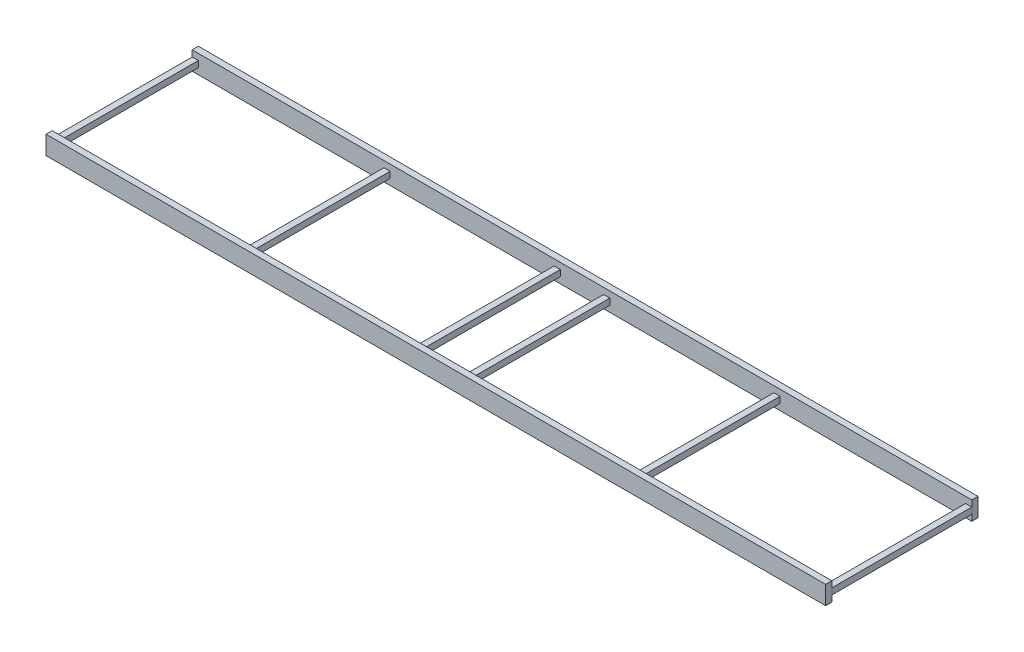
ISO-10303-21;
HEADER;
FILE_DESCRIPTION(('STEP AP214'),'2;1');
FILE_NAME('part.step','',(''),(''),'','','');
FILE_SCHEMA(('AUTOMOTIVE_DESIGN { 1 0 10303 214 1 1 1 1 }'));
ENDSEC;
DATA;
#1=APPLICATION_CONTEXT('core data for automotive mechanical design processes');
#2=APPLICATION_PROTOCOL_DEFINITION('international standard','automotive_design',2000,#1);
#3=PRODUCT_CONTEXT('',#1,'mechanical');
#4=PRODUCT('Part','Part','',(#3));
#5=PRODUCT_RELATED_PRODUCT_CATEGORY('part','',(#4));
#6=PRODUCT_DEFINITION_FORMATION('','',#4);
#7=PRODUCT_DEFINITION_CONTEXT('part definition',#1,'design');
#8=PRODUCT_DEFINITION('design','',#6,#7);
#9=PRODUCT_DEFINITION_SHAPE('','',#8);
#10=(LENGTH_UNIT() NAMED_UNIT(*) SI_UNIT(.MILLI.,.METRE.));
#11=(NAMED_UNIT(*) PLANE_ANGLE_UNIT() SI_UNIT($,.RADIAN.));
#12=(NAMED_UNIT(*) SI_UNIT($,.STERADIAN.) SOLID_ANGLE_UNIT());
#13=UNCERTAINTY_MEASURE_WITH_UNIT(LENGTH_MEASURE(1.E-05),#10,'distance_accuracy_value','');
#14=(GEOMETRIC_REPRESENTATION_CONTEXT(3) GLOBAL_UNCERTAINTY_ASSIGNED_CONTEXT((#13)) GLOBAL_UNIT_ASSIGNED_CONTEXT((#10,
#11,#12)) REPRESENTATION_CONTEXT('',''));
#15=CARTESIAN_POINT('',(0.,0.,0.));
#16=DIRECTION('',(0.,0.,1.));
#17=DIRECTION('',(1.,0.,0.));
#18=AXIS2_PLACEMENT_3D('',#15,#16,#17);
#19=CARTESIAN_POINT('',(200.,-4.7625,35.9125));
#20=DIRECTION('',(0.,0.,1.));
#21=DIRECTION('',(1.,0.,0.));
#22=AXIS2_PLACEMENT_3D('',#19,#20,#21);
#23=PLANE('',#22);
#24=DIRECTION('',(0.,-1.,0.));
#25=VECTOR('',#24,1.);
#26=CARTESIAN_POINT('',(196.825,-1.5875,35.9125));
#27=LINE('',#26,#25);
#28=CARTESIAN_POINT('',(196.825,1.5875,35.9125));
#29=VERTEX_POINT('',#28);
#30=CARTESIAN_POINT('',(196.825,-1.5875,35.9125));
#31=VERTEX_POINT('',#30);
#32=EDGE_CURVE('E173',#29,#31,#27,.T.);
#33=ORIENTED_EDGE('',*,*,#32,.T.);
#34=DIRECTION('',(1.,0.,0.));
#35=VECTOR('',#34,1.);
#36=CARTESIAN_POINT('',(200.,-1.5875,35.9125));
#37=LINE('',#36,#35);
#38=CARTESIAN_POINT('',(200.,-1.5875,35.9125));
#39=VERTEX_POINT('',#38);
#40=EDGE_CURVE('E168',#31,#39,#37,.T.);
#41=ORIENTED_EDGE('',*,*,#40,.T.);
#42=DIRECTION('',(0.,1.,0.));
#43=VECTOR('',#42,1.);
#44=CARTESIAN_POINT('',(200.,-1.5875,35.9125));
#45=LINE('',#44,#43);
#46=CARTESIAN_POINT('',(200.,1.5875,35.9125));
#47=VERTEX_POINT('',#46);
#48=EDGE_CURVE('E175',#39,#47,#45,.T.);
#49=ORIENTED_EDGE('',*,*,#48,.T.);
#50=DIRECTION('',(-1.,0.,0.));
#51=VECTOR('',#50,1.);
#52=CARTESIAN_POINT('',(200.,1.5875,35.9125));
#53=LINE('',#52,#51);
#54=EDGE_CURVE('E121',#47,#29,#53,.T.);
#55=ORIENTED_EDGE('',*,*,#54,.T.);
#56=EDGE_LOOP('',(#33,#41,#49,#55));
#57=FACE_BOUND('',#56,.T.);
#58=ADVANCED_FACE('F113',(#57),#23,.T.);
#59=CARTESIAN_POINT('',(200.,-1.5875,-37.5));
#60=DIRECTION('',(0.,1.,0.));
#61=DIRECTION('',(0.,0.,1.));
#62=AXIS2_PLACEMENT_3D('',#59,#60,#61);
#63=PLANE('',#62);
#64=DIRECTION('',(-1.,0.,0.));
#65=VECTOR('',#64,1.);
#66=CARTESIAN_POINT('',(200.,-1.5875,-35.9125));
#67=LINE('',#66,#65);
#68=CARTESIAN_POINT('',(200.,-1.5875,-35.9125));
#69=VERTEX_POINT('',#68);
#70=CARTESIAN_POINT('',(196.825,-1.5875,-35.9125));
#71=VERTEX_POINT('',#70);
#72=EDGE_CURVE('E13',#69,#71,#67,.T.);
#73=ORIENTED_EDGE('',*,*,#72,.F.);
#74=DIRECTION('',(0.,0.,1.));
#75=VECTOR('',#74,1.);
#76=CARTESIAN_POINT('',(200.,-1.5875,-37.5));
#77=LINE('',#76,#75);
#78=EDGE_CURVE('E148',#69,#39,#77,.T.);
#79=ORIENTED_EDGE('',*,*,#78,.T.);
#80=ORIENTED_EDGE('',*,*,#40,.F.);
#81=DIRECTION('',(0.,0.,1.));
#82=VECTOR('',#81,1.);
#83=CARTESIAN_POINT('',(196.825,-1.5875,-37.5));
#84=LINE('',#83,#82);
#85=EDGE_CURVE('E156',#71,#31,#84,.T.);
#86=ORIENTED_EDGE('',*,*,#85,.F.);
#87=EDGE_LOOP('',(#73,#79,#80,#86));
#88=FACE_BOUND('',#87,.T.);
#89=ADVANCED_FACE('F167',(#88),#63,.F.);
#90=CARTESIAN_POINT('',(200.,-1.5875,-37.5));
#91=DIRECTION('',(-1.,0.,0.));
#92=DIRECTION('',(0.,0.,1.));
#93=AXIS2_PLACEMENT_3D('',#90,#91,#92);
#94=PLANE('',#93);
#95=DIRECTION('',(0.,-1.,0.));
#96=VECTOR('',#95,1.);
#97=CARTESIAN_POINT('',(200.,-1.5875,-35.9125));
#98=LINE('',#97,#96);
#99=CARTESIAN_POINT('',(200.,1.5875,-35.9125));
#100=VERTEX_POINT('',#99);
#101=EDGE_CURVE('E127',#100,#69,#98,.T.);
#102=ORIENTED_EDGE('',*,*,#101,.F.);
#103=DIRECTION('',(0.,0.,1.));
#104=VECTOR('',#103,1.);
#105=CARTESIAN_POINT('',(200.,1.5875,-37.5));
#106=LINE('',#105,#104);
#107=EDGE_CURVE('E169',#100,#47,#106,.T.);
#108=ORIENTED_EDGE('',*,*,#107,.T.);
#109=ORIENTED_EDGE('',*,*,#48,.F.);
#110=ORIENTED_EDGE('',*,*,#78,.F.);
#111=EDGE_LOOP('',(#102,#108,#109,#110));
#112=FACE_BOUND('',#111,.T.);
#113=ADVANCED_FACE('F184',(#112),#94,.F.);
#114=CARTESIAN_POINT('',(200.,1.5875,-37.5));
#115=DIRECTION('',(0.,-1.,0.));
#116=DIRECTION('',(0.,0.,-1.));
#117=AXIS2_PLACEMENT_3D('',#114,#115,#116);
#118=PLANE('',#117);
#119=DIRECTION('',(1.,0.,0.));
#120=VECTOR('',#119,1.);
#121=CARTESIAN_POINT('',(200.,1.5875,-35.9125));
#122=LINE('',#121,#120);
#123=CARTESIAN_POINT('',(196.825,1.5875,-35.9125));
#124=VERTEX_POINT('',#123);
#125=EDGE_CURVE('E165',#124,#100,#122,.T.);
#126=ORIENTED_EDGE('',*,*,#125,.F.);
#127=DIRECTION('',(0.,0.,1.));
#128=VECTOR('',#127,1.);
#129=CARTESIAN_POINT('',(196.825,1.5875,-37.5));
#130=LINE('',#129,#128);
#131=EDGE_CURVE('E136',#124,#29,#130,.T.);
#132=ORIENTED_EDGE('',*,*,#131,.T.);
#133=ORIENTED_EDGE('',*,*,#54,.F.);
#134=ORIENTED_EDGE('',*,*,#107,.F.);
#135=EDGE_LOOP('',(#126,#132,#133,#134));
#136=FACE_BOUND('',#135,.T.);
#137=ADVANCED_FACE('F186',(#136),#118,.F.);
#138=CARTESIAN_POINT('',(196.825,-1.5875,-37.5));
#139=DIRECTION('',(1.,0.,0.));
#140=DIRECTION('',(0.,0.,-1.));
#141=AXIS2_PLACEMENT_3D('',#138,#139,#140);
#142=PLANE('',#141);
#143=DIRECTION('',(0.,1.,0.));
#144=VECTOR('',#143,1.);
#145=CARTESIAN_POINT('',(196.825,-1.5875,-35.9125));
#146=LINE('',#145,#144);
#147=EDGE_CURVE('E160',#71,#124,#146,.T.);
#148=ORIENTED_EDGE('',*,*,#147,.F.);
#149=ORIENTED_EDGE('',*,*,#85,.T.);
#150=ORIENTED_EDGE('',*,*,#32,.F.);
#151=ORIENTED_EDGE('',*,*,#131,.F.);
#152=EDGE_LOOP('',(#148,#149,#150,#151));
#153=FACE_BOUND('',#152,.T.);
#154=ADVANCED_FACE('F115',(#153),#142,.F.);
#155=CARTESIAN_POINT('',(200.,-4.7625,-35.9125));
#156=DIRECTION('',(0.,0.,-1.));
#157=DIRECTION('',(-1.,0.,0.));
#158=AXIS2_PLACEMENT_3D('',#155,#156,#157);
#159=PLANE('',#158);
#160=ORIENTED_EDGE('',*,*,#147,.T.);
#161=ORIENTED_EDGE('',*,*,#125,.T.);
#162=ORIENTED_EDGE('',*,*,#101,.T.);
#163=ORIENTED_EDGE('',*,*,#72,.T.);
#164=EDGE_LOOP('',(#160,#161,#162,#163));
#165=FACE_BOUND('',#164,.T.);
#166=ADVANCED_FACE('F164',(#165),#159,.T.);
#167=CLOSED_SHELL('',(#58,#89,#113,#137,#154,#166));
#168=MANIFOLD_SOLID_BREP('B2',#167);
#169=CARTESIAN_POINT('',(200.,-4.7625,35.9125));
#170=DIRECTION('',(0.,0.,1.));
#171=DIRECTION('',(1.,0.,0.));
#172=AXIS2_PLACEMENT_3D('',#169,#170,#171);
#173=PLANE('',#172);
#174=DIRECTION('',(0.,1.,0.));
#175=VECTOR('',#174,1.);
#176=CARTESIAN_POINT('',(101.5875,-1.5875,35.9125));
#177=LINE('',#176,#175);
#178=CARTESIAN_POINT('',(101.5875,-1.5875,35.9125));
#179=VERTEX_POINT('',#178);
#180=CARTESIAN_POINT('',(101.5875,1.5875,35.9125));
#181=VERTEX_POINT('',#180);
#182=EDGE_CURVE('E313',#179,#181,#177,.T.);
#183=ORIENTED_EDGE('',*,*,#182,.T.);
#184=DIRECTION('',(-1.,0.,0.));
#185=VECTOR('',#184,1.);
#186=CARTESIAN_POINT('',(98.4125000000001,1.5875,35.9125));
#187=LINE('',#186,#185);
#188=CARTESIAN_POINT('',(98.4125000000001,1.5875,35.9125));
#189=VERTEX_POINT('',#188);
#190=EDGE_CURVE('E315',#181,#189,#187,.T.);
#191=ORIENTED_EDGE('',*,*,#190,.T.);
#192=DIRECTION('',(0.,-1.,0.));
#193=VECTOR('',#192,1.);
#194=CARTESIAN_POINT('',(98.4125000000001,-1.5875,35.9125));
#195=LINE('',#194,#193);
#196=CARTESIAN_POINT('',(98.4125000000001,-1.5875,35.9125));
#197=VERTEX_POINT('',#196);
#198=EDGE_CURVE('E326',#189,#197,#195,.T.);
#199=ORIENTED_EDGE('',*,*,#198,.T.);
#200=DIRECTION('',(1.,0.,0.));
#201=VECTOR('',#200,1.);
#202=CARTESIAN_POINT('',(98.4125000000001,-1.5875,35.9125));
#203=LINE('',#202,#201);
#204=EDGE_CURVE('E266',#197,#179,#203,.T.);
#205=ORIENTED_EDGE('',*,*,#204,.T.);
#206=EDGE_LOOP('',(#183,#191,#199,#205));
#207=FACE_BOUND('',#206,.T.);
#208=ADVANCED_FACE('F258',(#207),#173,.T.);
#209=CARTESIAN_POINT('',(98.4125000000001,-1.5875,37.5));
#210=DIRECTION('',(0.,1.,0.));
#211=DIRECTION('',(0.,0.,1.));
#212=AXIS2_PLACEMENT_3D('',#209,#210,#211);
#213=PLANE('',#212);
#214=DIRECTION('',(-1.,0.,0.));
#215=VECTOR('',#214,1.);
#216=CARTESIAN_POINT('',(98.4125000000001,-1.5875,-35.9125));
#217=LINE('',#216,#215);
#218=CARTESIAN_POINT('',(101.5875,-1.5875,-35.9125));
#219=VERTEX_POINT('',#218);
#220=CARTESIAN_POINT('',(98.4124999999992,-1.5875,-35.9125));
#221=VERTEX_POINT('',#220);
#222=EDGE_CURVE('E111',#219,#221,#217,.T.);
#223=ORIENTED_EDGE('',*,*,#222,.F.);
#224=DIRECTION('',(0.,0.,-1.));
#225=VECTOR('',#224,1.);
#226=CARTESIAN_POINT('',(101.5875,-1.5875,37.5));
#227=LINE('',#226,#225);
#228=EDGE_CURVE('E320',#179,#219,#227,.T.);
#229=ORIENTED_EDGE('',*,*,#228,.F.);
#230=ORIENTED_EDGE('',*,*,#204,.F.);
#231=DIRECTION('',(0.,0.,-1.));
#232=VECTOR('',#231,1.);
#233=CARTESIAN_POINT('',(98.4125000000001,-1.5875,37.5));
#234=LINE('',#233,#232);
#235=EDGE_CURVE('E307',#197,#221,#234,.T.);
#236=ORIENTED_EDGE('',*,*,#235,.T.);
#237=EDGE_LOOP('',(#223,#229,#230,#236));
#238=FACE_BOUND('',#237,.T.);
#239=ADVANCED_FACE('F312',(#238),#213,.F.);
#240=CARTESIAN_POINT('',(98.4125000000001,-1.5875,37.5));
#241=DIRECTION('',(1.,0.,0.));
#242=DIRECTION('',(0.,0.,-1.));
#243=AXIS2_PLACEMENT_3D('',#240,#241,#242);
#244=PLANE('',#243);
#245=DIRECTION('',(0.,1.,0.));
#246=VECTOR('',#245,1.);
#247=CARTESIAN_POINT('',(98.4125,-1.5875,-35.9125));
#248=LINE('',#247,#246);
#249=CARTESIAN_POINT('',(98.4125,1.5875,-35.9125));
#250=VERTEX_POINT('',#249);
#251=EDGE_CURVE('E296',#221,#250,#248,.T.);
#252=ORIENTED_EDGE('',*,*,#251,.F.);
#253=ORIENTED_EDGE('',*,*,#235,.F.);
#254=ORIENTED_EDGE('',*,*,#198,.F.);
#255=DIRECTION('',(0.,0.,-1.));
#256=VECTOR('',#255,1.);
#257=CARTESIAN_POINT('',(98.4125000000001,1.5875,37.5));
#258=LINE('',#257,#256);
#259=EDGE_CURVE('E309',#189,#250,#258,.T.);
#260=ORIENTED_EDGE('',*,*,#259,.T.);
#261=EDGE_LOOP('',(#252,#253,#254,#260));
#262=FACE_BOUND('',#261,.T.);
#263=ADVANCED_FACE('F305',(#262),#244,.F.);
#264=CARTESIAN_POINT('',(98.4125000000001,1.5875,37.5));
#265=DIRECTION('',(0.,-1.,0.));
#266=DIRECTION('',(0.,0.,-1.));
#267=AXIS2_PLACEMENT_3D('',#264,#265,#266);
#268=PLANE('',#267);
#269=DIRECTION('',(1.,0.,0.));
#270=VECTOR('',#269,1.);
#271=CARTESIAN_POINT('',(98.4125000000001,1.5875,-35.9125));
#272=LINE('',#271,#270);
#273=CARTESIAN_POINT('',(101.5875,1.5875,-35.9125));
#274=VERTEX_POINT('',#273);
#275=EDGE_CURVE('E310',#250,#274,#272,.T.);
#276=ORIENTED_EDGE('',*,*,#275,.F.);
#277=ORIENTED_EDGE('',*,*,#259,.F.);
#278=ORIENTED_EDGE('',*,*,#190,.F.);
#279=DIRECTION('',(0.,0.,-1.));
#280=VECTOR('',#279,1.);
#281=CARTESIAN_POINT('',(101.5875,1.5875,37.5));
#282=LINE('',#281,#280);
#283=EDGE_CURVE('E317',#181,#274,#282,.T.);
#284=ORIENTED_EDGE('',*,*,#283,.T.);
#285=EDGE_LOOP('',(#276,#277,#278,#284));
#286=FACE_BOUND('',#285,.T.);
#287=ADVANCED_FACE('F331',(#286),#268,.F.);
#288=CARTESIAN_POINT('',(101.5875,-1.5875,37.5));
#289=DIRECTION('',(-1.,0.,0.));
#290=DIRECTION('',(0.,0.,1.));
#291=AXIS2_PLACEMENT_3D('',#288,#289,#290);
#292=PLANE('',#291);
#293=DIRECTION('',(0.,-1.,0.));
#294=VECTOR('',#293,1.);
#295=CARTESIAN_POINT('',(101.5875,-1.5875,-35.9125));
#296=LINE('',#295,#294);
#297=EDGE_CURVE('E272',#274,#219,#296,.T.);
#298=ORIENTED_EDGE('',*,*,#297,.F.);
#299=ORIENTED_EDGE('',*,*,#283,.F.);
#300=ORIENTED_EDGE('',*,*,#182,.F.);
#301=ORIENTED_EDGE('',*,*,#228,.T.);
#302=EDGE_LOOP('',(#298,#299,#300,#301));
#303=FACE_BOUND('',#302,.T.);
#304=ADVANCED_FACE('F260',(#303),#292,.F.);
#305=CARTESIAN_POINT('',(200.,-4.7625,-35.9125));
#306=DIRECTION('',(0.,0.,-1.));
#307=DIRECTION('',(-1.,0.,0.));
#308=AXIS2_PLACEMENT_3D('',#305,#306,#307);
#309=PLANE('',#308);
#310=ORIENTED_EDGE('',*,*,#297,.T.);
#311=ORIENTED_EDGE('',*,*,#222,.T.);
#312=ORIENTED_EDGE('',*,*,#251,.T.);
#313=ORIENTED_EDGE('',*,*,#275,.T.);
#314=EDGE_LOOP('',(#310,#311,#312,#313));
#315=FACE_BOUND('',#314,.T.);
#316=ADVANCED_FACE('F295',(#315),#309,.T.);
#317=CLOSED_SHELL('',(#208,#239,#263,#287,#304,#316));
#318=MANIFOLD_SOLID_BREP('B7',#317);
#319=CARTESIAN_POINT('',(200.,-4.7625,35.9125));
#320=DIRECTION('',(0.,0.,1.));
#321=DIRECTION('',(1.,0.,0.));
#322=AXIS2_PLACEMENT_3D('',#319,#320,#321);
#323=PLANE('',#322);
#324=DIRECTION('',(0.,1.,0.));
#325=VECTOR('',#324,1.);
#326=CARTESIAN_POINT('',(14.2875,-1.5875,35.9125));
#327=LINE('',#326,#325);
#328=CARTESIAN_POINT('',(14.2875000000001,-1.5875,35.9125));
#329=VERTEX_POINT('',#328);
#330=CARTESIAN_POINT('',(14.2875000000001,1.5875,35.9125));
#331=VERTEX_POINT('',#330);
#332=EDGE_CURVE('E458',#329,#331,#327,.T.);
#333=ORIENTED_EDGE('',*,*,#332,.T.);
#334=DIRECTION('',(-1.,0.,0.));
#335=VECTOR('',#334,1.);
#336=CARTESIAN_POINT('',(11.1125,1.5875,35.9125));
#337=LINE('',#336,#335);
#338=CARTESIAN_POINT('',(11.1125,1.5875,35.9125));
#339=VERTEX_POINT('',#338);
#340=EDGE_CURVE('E460',#331,#339,#337,.T.);
#341=ORIENTED_EDGE('',*,*,#340,.T.);
#342=DIRECTION('',(0.,-1.,0.));
#343=VECTOR('',#342,1.);
#344=CARTESIAN_POINT('',(11.1125,-1.5875,35.9125));
#345=LINE('',#344,#343);
#346=CARTESIAN_POINT('',(11.1125,-1.5875,35.9125));
#347=VERTEX_POINT('',#346);
#348=EDGE_CURVE('E471',#339,#347,#345,.T.);
#349=ORIENTED_EDGE('',*,*,#348,.T.);
#350=DIRECTION('',(1.,0.,0.));
#351=VECTOR('',#350,1.);
#352=CARTESIAN_POINT('',(11.1125,-1.5875,35.9125));
#353=LINE('',#352,#351);
#354=EDGE_CURVE('E411',#347,#329,#353,.T.);
#355=ORIENTED_EDGE('',*,*,#354,.T.);
#356=EDGE_LOOP('',(#333,#341,#349,#355));
#357=FACE_BOUND('',#356,.T.);
#358=ADVANCED_FACE('F403',(#357),#323,.T.);
#359=CARTESIAN_POINT('',(11.1125,-1.5875,37.5));
#360=DIRECTION('',(0.,1.,0.));
#361=DIRECTION('',(0.,0.,1.));
#362=AXIS2_PLACEMENT_3D('',#359,#360,#361);
#363=PLANE('',#362);
#364=DIRECTION('',(-1.,0.,0.));
#365=VECTOR('',#364,1.);
#366=CARTESIAN_POINT('',(11.1125,-1.5875,-35.9125));
#367=LINE('',#366,#365);
#368=CARTESIAN_POINT('',(14.2875,-1.5875,-35.9125));
#369=VERTEX_POINT('',#368);
#370=CARTESIAN_POINT('',(11.1124999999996,-1.5875,-35.9125));
#371=VERTEX_POINT('',#370);
#372=EDGE_CURVE('E256',#369,#371,#367,.T.);
#373=ORIENTED_EDGE('',*,*,#372,.F.);
#374=DIRECTION('',(0.,0.,-1.));
#375=VECTOR('',#374,1.);
#376=CARTESIAN_POINT('',(14.2875,-1.5875,37.5));
#377=LINE('',#376,#375);
#378=EDGE_CURVE('E465',#329,#369,#377,.T.);
#379=ORIENTED_EDGE('',*,*,#378,.F.);
#380=ORIENTED_EDGE('',*,*,#354,.F.);
#381=DIRECTION('',(0.,0.,-1.));
#382=VECTOR('',#381,1.);
#383=CARTESIAN_POINT('',(11.1125,-1.5875,37.5));
#384=LINE('',#383,#382);
#385=EDGE_CURVE('E452',#347,#371,#384,.T.);
#386=ORIENTED_EDGE('',*,*,#385,.T.);
#387=EDGE_LOOP('',(#373,#379,#380,#386));
#388=FACE_BOUND('',#387,.T.);
#389=ADVANCED_FACE('F457',(#388),#363,.F.);
#390=CARTESIAN_POINT('',(11.1125,-1.5875,37.5));
#391=DIRECTION('',(1.,0.,0.));
#392=DIRECTION('',(0.,0.,-1.));
#393=AXIS2_PLACEMENT_3D('',#390,#391,#392);
#394=PLANE('',#393);
#395=DIRECTION('',(0.,1.,0.));
#396=VECTOR('',#395,1.);
#397=CARTESIAN_POINT('',(11.1125,-1.5875,-35.9125));
#398=LINE('',#397,#396);
#399=CARTESIAN_POINT('',(11.1125,1.5875,-35.9125));
#400=VERTEX_POINT('',#399);
#401=EDGE_CURVE('E441',#371,#400,#398,.T.);
#402=ORIENTED_EDGE('',*,*,#401,.F.);
#403=ORIENTED_EDGE('',*,*,#385,.F.);
#404=ORIENTED_EDGE('',*,*,#348,.F.);
#405=DIRECTION('',(0.,0.,-1.));
#406=VECTOR('',#405,1.);
#407=CARTESIAN_POINT('',(11.1125,1.5875,37.5));
#408=LINE('',#407,#406);
#409=EDGE_CURVE('E454',#339,#400,#408,.T.);
#410=ORIENTED_EDGE('',*,*,#409,.T.);
#411=EDGE_LOOP('',(#402,#403,#404,#410));
#412=FACE_BOUND('',#411,.T.);
#413=ADVANCED_FACE('F450',(#412),#394,.F.);
#414=CARTESIAN_POINT('',(11.1125,1.5875,37.5));
#415=DIRECTION('',(0.,-1.,0.));
#416=DIRECTION('',(0.,0.,-1.));
#417=AXIS2_PLACEMENT_3D('',#414,#415,#416);
#418=PLANE('',#417);
#419=DIRECTION('',(1.,0.,0.));
#420=VECTOR('',#419,1.);
#421=CARTESIAN_POINT('',(11.1125,1.5875,-35.9125));
#422=LINE('',#421,#420);
#423=CARTESIAN_POINT('',(14.2875,1.5875,-35.9125));
#424=VERTEX_POINT('',#423);
#425=EDGE_CURVE('E455',#400,#424,#422,.T.);
#426=ORIENTED_EDGE('',*,*,#425,.F.);
#427=ORIENTED_EDGE('',*,*,#409,.F.);
#428=ORIENTED_EDGE('',*,*,#340,.F.);
#429=DIRECTION('',(0.,0.,-1.));
#430=VECTOR('',#429,1.);
#431=CARTESIAN_POINT('',(14.2875,1.5875,37.5));
#432=LINE('',#431,#430);
#433=EDGE_CURVE('E462',#331,#424,#432,.T.);
#434=ORIENTED_EDGE('',*,*,#433,.T.);
#435=EDGE_LOOP('',(#426,#427,#428,#434));
#436=FACE_BOUND('',#435,.T.);
#437=ADVANCED_FACE('F476',(#436),#418,.F.);
#438=CARTESIAN_POINT('',(14.2875,-1.5875,37.5));
#439=DIRECTION('',(-1.,0.,0.));
#440=DIRECTION('',(0.,0.,1.));
#441=AXIS2_PLACEMENT_3D('',#438,#439,#440);
#442=PLANE('',#441);
#443=DIRECTION('',(0.,-1.,0.));
#444=VECTOR('',#443,1.);
#445=CARTESIAN_POINT('',(14.2875,-1.5875,-35.9125));
#446=LINE('',#445,#444);
#447=EDGE_CURVE('E417',#424,#369,#446,.T.);
#448=ORIENTED_EDGE('',*,*,#447,.F.);
#449=ORIENTED_EDGE('',*,*,#433,.F.);
#450=ORIENTED_EDGE('',*,*,#332,.F.);
#451=ORIENTED_EDGE('',*,*,#378,.T.);
#452=EDGE_LOOP('',(#448,#449,#450,#451));
#453=FACE_BOUND('',#452,.T.);
#454=ADVANCED_FACE('F405',(#453),#442,.F.);
#455=CARTESIAN_POINT('',(200.,-4.7625,-35.9125));
#456=DIRECTION('',(0.,0.,-1.));
#457=DIRECTION('',(-1.,0.,0.));
#458=AXIS2_PLACEMENT_3D('',#455,#456,#457);
#459=PLANE('',#458);
#460=ORIENTED_EDGE('',*,*,#447,.T.);
#461=ORIENTED_EDGE('',*,*,#372,.T.);
#462=ORIENTED_EDGE('',*,*,#401,.T.);
#463=ORIENTED_EDGE('',*,*,#425,.T.);
#464=EDGE_LOOP('',(#460,#461,#462,#463));
#465=FACE_BOUND('',#464,.T.);
#466=ADVANCED_FACE('F440',(#465),#459,.T.);
#467=CLOSED_SHELL('',(#358,#389,#413,#437,#454,#466));
#468=MANIFOLD_SOLID_BREP('B105',#467);
#469=CARTESIAN_POINT('',(200.,-4.7625,35.9125));
#470=DIRECTION('',(0.,0.,1.));
#471=DIRECTION('',(1.,0.,0.));
#472=AXIS2_PLACEMENT_3D('',#469,#470,#471);
#473=PLANE('',#472);
#474=DIRECTION('',(0.,1.,0.));
#475=VECTOR('',#474,1.);
#476=CARTESIAN_POINT('',(-11.1125,-1.5875,35.9125));
#477=LINE('',#476,#475);
#478=CARTESIAN_POINT('',(-11.1124999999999,-1.5875,35.9125));
#479=VERTEX_POINT('',#478);
#480=CARTESIAN_POINT('',(-11.1124999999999,1.5875,35.9125));
#481=VERTEX_POINT('',#480);
#482=EDGE_CURVE('E603',#479,#481,#477,.T.);
#483=ORIENTED_EDGE('',*,*,#482,.T.);
#484=DIRECTION('',(-1.,0.,0.));
#485=VECTOR('',#484,1.);
#486=CARTESIAN_POINT('',(-14.2875,1.5875,35.9125));
#487=LINE('',#486,#485);
#488=CARTESIAN_POINT('',(-14.2875,1.5875,35.9125));
#489=VERTEX_POINT('',#488);
#490=EDGE_CURVE('E605',#481,#489,#487,.T.);
#491=ORIENTED_EDGE('',*,*,#490,.T.);
#492=DIRECTION('',(0.,-1.,0.));
#493=VECTOR('',#492,1.);
#494=CARTESIAN_POINT('',(-14.2875,-1.5875,35.9125));
#495=LINE('',#494,#493);
#496=CARTESIAN_POINT('',(-14.2875,-1.5875,35.9125));
#497=VERTEX_POINT('',#496);
#498=EDGE_CURVE('E616',#489,#497,#495,.T.);
#499=ORIENTED_EDGE('',*,*,#498,.T.);
#500=DIRECTION('',(1.,0.,0.));
#501=VECTOR('',#500,1.);
#502=CARTESIAN_POINT('',(-14.2875,-1.5875,35.9125));
#503=LINE('',#502,#501);
#504=EDGE_CURVE('E556',#497,#479,#503,.T.);
#505=ORIENTED_EDGE('',*,*,#504,.T.);
#506=EDGE_LOOP('',(#483,#491,#499,#505));
#507=FACE_BOUND('',#506,.T.);
#508=ADVANCED_FACE('F548',(#507),#473,.T.);
#509=CARTESIAN_POINT('',(-14.2875,-1.5875,37.5));
#510=DIRECTION('',(0.,1.,0.));
#511=DIRECTION('',(0.,0.,1.));
#512=AXIS2_PLACEMENT_3D('',#509,#510,#511);
#513=PLANE('',#512);
#514=DIRECTION('',(-1.,0.,0.));
#515=VECTOR('',#514,1.);
#516=CARTESIAN_POINT('',(-14.2875,-1.5875,-35.9125));
#517=LINE('',#516,#515);
#518=CARTESIAN_POINT('',(-11.1125,-1.5875,-35.9125));
#519=VERTEX_POINT('',#518);
#520=CARTESIAN_POINT('',(-14.2875000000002,-1.5875,-35.9125));
#521=VERTEX_POINT('',#520);
#522=EDGE_CURVE('E401',#519,#521,#517,.T.);
#523=ORIENTED_EDGE('',*,*,#522,.F.);
#524=DIRECTION('',(0.,0.,-1.));
#525=VECTOR('',#524,1.);
#526=CARTESIAN_POINT('',(-11.1125,-1.5875,37.5));
#527=LINE('',#526,#525);
#528=EDGE_CURVE('E610',#479,#519,#527,.T.);
#529=ORIENTED_EDGE('',*,*,#528,.F.);
#530=ORIENTED_EDGE('',*,*,#504,.F.);
#531=DIRECTION('',(0.,0.,-1.));
#532=VECTOR('',#531,1.);
#533=CARTESIAN_POINT('',(-14.2875,-1.5875,37.5));
#534=LINE('',#533,#532);
#535=EDGE_CURVE('E597',#497,#521,#534,.T.);
#536=ORIENTED_EDGE('',*,*,#535,.T.);
#537=EDGE_LOOP('',(#523,#529,#530,#536));
#538=FACE_BOUND('',#537,.T.);
#539=ADVANCED_FACE('F602',(#538),#513,.F.);
#540=CARTESIAN_POINT('',(-14.2875,-1.5875,37.5));
#541=DIRECTION('',(1.,0.,0.));
#542=DIRECTION('',(0.,0.,-1.));
#543=AXIS2_PLACEMENT_3D('',#540,#541,#542);
#544=PLANE('',#543);
#545=DIRECTION('',(0.,1.,0.));
#546=VECTOR('',#545,1.);
#547=CARTESIAN_POINT('',(-14.2875,-1.5875,-35.9125));
#548=LINE('',#547,#546);
#549=CARTESIAN_POINT('',(-14.2875,1.5875,-35.9125));
#550=VERTEX_POINT('',#549);
#551=EDGE_CURVE('E586',#521,#550,#548,.T.);
#552=ORIENTED_EDGE('',*,*,#551,.F.);
#553=ORIENTED_EDGE('',*,*,#535,.F.);
#554=ORIENTED_EDGE('',*,*,#498,.F.);
#555=DIRECTION('',(0.,0.,-1.));
#556=VECTOR('',#555,1.);
#557=CARTESIAN_POINT('',(-14.2875,1.5875,37.5));
#558=LINE('',#557,#556);
#559=EDGE_CURVE('E599',#489,#550,#558,.T.);
#560=ORIENTED_EDGE('',*,*,#559,.T.);
#561=EDGE_LOOP('',(#552,#553,#554,#560));
#562=FACE_BOUND('',#561,.T.);
#563=ADVANCED_FACE('F595',(#562),#544,.F.);
#564=CARTESIAN_POINT('',(-14.2875,1.5875,37.5));
#565=DIRECTION('',(0.,-1.,0.));
#566=DIRECTION('',(0.,0.,-1.));
#567=AXIS2_PLACEMENT_3D('',#564,#565,#566);
#568=PLANE('',#567);
#569=DIRECTION('',(1.,0.,0.));
#570=VECTOR('',#569,1.);
#571=CARTESIAN_POINT('',(-14.2875,1.5875,-35.9125));
#572=LINE('',#571,#570);
#573=CARTESIAN_POINT('',(-11.1125,1.5875,-35.9125));
#574=VERTEX_POINT('',#573);
#575=EDGE_CURVE('E600',#550,#574,#572,.T.);
#576=ORIENTED_EDGE('',*,*,#575,.F.);
#577=ORIENTED_EDGE('',*,*,#559,.F.);
#578=ORIENTED_EDGE('',*,*,#490,.F.);
#579=DIRECTION('',(0.,0.,-1.));
#580=VECTOR('',#579,1.);
#581=CARTESIAN_POINT('',(-11.1125,1.5875,37.5));
#582=LINE('',#581,#580);
#583=EDGE_CURVE('E607',#481,#574,#582,.T.);
#584=ORIENTED_EDGE('',*,*,#583,.T.);
#585=EDGE_LOOP('',(#576,#577,#578,#584));
#586=FACE_BOUND('',#585,.T.);
#587=ADVANCED_FACE('F621',(#586),#568,.F.);
#588=CARTESIAN_POINT('',(-11.1125,-1.5875,37.5));
#589=DIRECTION('',(-1.,0.,0.));
#590=DIRECTION('',(0.,0.,1.));
#591=AXIS2_PLACEMENT_3D('',#588,#589,#590);
#592=PLANE('',#591);
#593=DIRECTION('',(0.,-1.,0.));
#594=VECTOR('',#593,1.);
#595=CARTESIAN_POINT('',(-11.1125,-1.5875,-35.9125));
#596=LINE('',#595,#594);
#597=EDGE_CURVE('E562',#574,#519,#596,.T.);
#598=ORIENTED_EDGE('',*,*,#597,.F.);
#599=ORIENTED_EDGE('',*,*,#583,.F.);
#600=ORIENTED_EDGE('',*,*,#482,.F.);
#601=ORIENTED_EDGE('',*,*,#528,.T.);
#602=EDGE_LOOP('',(#598,#599,#600,#601));
#603=FACE_BOUND('',#602,.T.);
#604=ADVANCED_FACE('F550',(#603),#592,.F.);
#605=CARTESIAN_POINT('',(200.,-4.7625,-35.9125));
#606=DIRECTION('',(0.,0.,-1.));
#607=DIRECTION('',(-1.,0.,0.));
#608=AXIS2_PLACEMENT_3D('',#605,#606,#607);
#609=PLANE('',#608);
#610=ORIENTED_EDGE('',*,*,#597,.T.);
#611=ORIENTED_EDGE('',*,*,#522,.T.);
#612=ORIENTED_EDGE('',*,*,#551,.T.);
#613=ORIENTED_EDGE('',*,*,#575,.T.);
#614=EDGE_LOOP('',(#610,#611,#612,#613));
#615=FACE_BOUND('',#614,.T.);
#616=ADVANCED_FACE('F585',(#615),#609,.T.);
#617=CLOSED_SHELL('',(#508,#539,#563,#587,#604,#616));
#618=MANIFOLD_SOLID_BREP('B250',#617);
#619=CARTESIAN_POINT('',(200.,-4.7625,35.9125));
#620=DIRECTION('',(0.,0.,1.));
#621=DIRECTION('',(1.,0.,0.));
#622=AXIS2_PLACEMENT_3D('',#619,#620,#621);
#623=PLANE('',#622);
#624=DIRECTION('',(0.,1.,0.));
#625=VECTOR('',#624,1.);
#626=CARTESIAN_POINT('',(-98.4125,-1.5875,35.9125));
#627=LINE('',#626,#625);
#628=CARTESIAN_POINT('',(-98.4124999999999,-1.5875,35.9125));
#629=VERTEX_POINT('',#628);
#630=CARTESIAN_POINT('',(-98.4124999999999,1.5875,35.9125));
#631=VERTEX_POINT('',#630);
#632=EDGE_CURVE('E748',#629,#631,#627,.T.);
#633=ORIENTED_EDGE('',*,*,#632,.T.);
#634=DIRECTION('',(-1.,0.,0.));
#635=VECTOR('',#634,1.);
#636=CARTESIAN_POINT('',(-101.5875,1.5875,35.9125));
#637=LINE('',#636,#635);
#638=CARTESIAN_POINT('',(-101.5875,1.5875,35.9125));
#639=VERTEX_POINT('',#638);
#640=EDGE_CURVE('E750',#631,#639,#637,.T.);
#641=ORIENTED_EDGE('',*,*,#640,.T.);
#642=DIRECTION('',(0.,-1.,0.));
#643=VECTOR('',#642,1.);
#644=CARTESIAN_POINT('',(-101.5875,-1.5875,35.9125));
#645=LINE('',#644,#643);
#646=CARTESIAN_POINT('',(-101.5875,-1.5875,35.9125));
#647=VERTEX_POINT('',#646);
#648=EDGE_CURVE('E761',#639,#647,#645,.T.);
#649=ORIENTED_EDGE('',*,*,#648,.T.);
#650=DIRECTION('',(1.,0.,0.));
#651=VECTOR('',#650,1.);
#652=CARTESIAN_POINT('',(-101.5875,-1.5875,35.9125));
#653=LINE('',#652,#651);
#654=EDGE_CURVE('E701',#647,#629,#653,.T.);
#655=ORIENTED_EDGE('',*,*,#654,.T.);
#656=EDGE_LOOP('',(#633,#641,#649,#655));
#657=FACE_BOUND('',#656,.T.);
#658=ADVANCED_FACE('F693',(#657),#623,.T.);
#659=CARTESIAN_POINT('',(-101.5875,-1.5875,37.5));
#660=DIRECTION('',(0.,1.,0.));
#661=DIRECTION('',(0.,0.,1.));
#662=AXIS2_PLACEMENT_3D('',#659,#660,#661);
#663=PLANE('',#662);
#664=DIRECTION('',(-1.,0.,0.));
#665=VECTOR('',#664,1.);
#666=CARTESIAN_POINT('',(-101.5875,-1.5875,-35.9125));
#667=LINE('',#666,#665);
#668=CARTESIAN_POINT('',(-98.4125,-1.5875,-35.9125));
#669=VERTEX_POINT('',#668);
#670=CARTESIAN_POINT('',(-101.587500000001,-1.5875,-35.9125));
#671=VERTEX_POINT('',#670);
#672=EDGE_CURVE('E546',#669,#671,#667,.T.);
#673=ORIENTED_EDGE('',*,*,#672,.F.);
#674=DIRECTION('',(0.,0.,-1.));
#675=VECTOR('',#674,1.);
#676=CARTESIAN_POINT('',(-98.4125,-1.5875,37.5));
#677=LINE('',#676,#675);
#678=EDGE_CURVE('E755',#629,#669,#677,.T.);
#679=ORIENTED_EDGE('',*,*,#678,.F.);
#680=ORIENTED_EDGE('',*,*,#654,.F.);
#681=DIRECTION('',(0.,0.,-1.));
#682=VECTOR('',#681,1.);
#683=CARTESIAN_POINT('',(-101.5875,-1.5875,37.5));
#684=LINE('',#683,#682);
#685=EDGE_CURVE('E742',#647,#671,#684,.T.);
#686=ORIENTED_EDGE('',*,*,#685,.T.);
#687=EDGE_LOOP('',(#673,#679,#680,#686));
#688=FACE_BOUND('',#687,.T.);
#689=ADVANCED_FACE('F747',(#688),#663,.F.);
#690=CARTESIAN_POINT('',(-101.5875,-1.5875,37.5));
#691=DIRECTION('',(1.,0.,0.));
#692=DIRECTION('',(0.,0.,-1.));
#693=AXIS2_PLACEMENT_3D('',#690,#691,#692);
#694=PLANE('',#693);
#695=DIRECTION('',(0.,1.,0.));
#696=VECTOR('',#695,1.);
#697=CARTESIAN_POINT('',(-101.5875,-1.5875,-35.9125));
#698=LINE('',#697,#696);
#699=CARTESIAN_POINT('',(-101.5875,1.5875,-35.9125));
#700=VERTEX_POINT('',#699);
#701=EDGE_CURVE('E731',#671,#700,#698,.T.);
#702=ORIENTED_EDGE('',*,*,#701,.F.);
#703=ORIENTED_EDGE('',*,*,#685,.F.);
#704=ORIENTED_EDGE('',*,*,#648,.F.);
#705=DIRECTION('',(0.,0.,-1.));
#706=VECTOR('',#705,1.);
#707=CARTESIAN_POINT('',(-101.5875,1.5875,37.5));
#708=LINE('',#707,#706);
#709=EDGE_CURVE('E744',#639,#700,#708,.T.);
#710=ORIENTED_EDGE('',*,*,#709,.T.);
#711=EDGE_LOOP('',(#702,#703,#704,#710));
#712=FACE_BOUND('',#711,.T.);
#713=ADVANCED_FACE('F740',(#712),#694,.F.);
#714=CARTESIAN_POINT('',(-101.5875,1.5875,37.5));
#715=DIRECTION('',(0.,-1.,0.));
#716=DIRECTION('',(0.,0.,-1.));
#717=AXIS2_PLACEMENT_3D('',#714,#715,#716);
#718=PLANE('',#717);
#719=DIRECTION('',(1.,0.,0.));
#720=VECTOR('',#719,1.);
#721=CARTESIAN_POINT('',(-101.5875,1.5875,-35.9125));
#722=LINE('',#721,#720);
#723=CARTESIAN_POINT('',(-98.4125,1.5875,-35.9125));
#724=VERTEX_POINT('',#723);
#725=EDGE_CURVE('E745',#700,#724,#722,.T.);
#726=ORIENTED_EDGE('',*,*,#725,.F.);
#727=ORIENTED_EDGE('',*,*,#709,.F.);
#728=ORIENTED_EDGE('',*,*,#640,.F.);
#729=DIRECTION('',(0.,0.,-1.));
#730=VECTOR('',#729,1.);
#731=CARTESIAN_POINT('',(-98.4125,1.5875,37.5));
#732=LINE('',#731,#730);
#733=EDGE_CURVE('E752',#631,#724,#732,.T.);
#734=ORIENTED_EDGE('',*,*,#733,.T.);
#735=EDGE_LOOP('',(#726,#727,#728,#734));
#736=FACE_BOUND('',#735,.T.);
#737=ADVANCED_FACE('F766',(#736),#718,.F.);
#738=CARTESIAN_POINT('',(-98.4125,-1.5875,37.5));
#739=DIRECTION('',(-1.,0.,0.));
#740=DIRECTION('',(0.,0.,1.));
#741=AXIS2_PLACEMENT_3D('',#738,#739,#740);
#742=PLANE('',#741);
#743=DIRECTION('',(0.,-1.,0.));
#744=VECTOR('',#743,1.);
#745=CARTESIAN_POINT('',(-98.4125,-1.5875,-35.9125));
#746=LINE('',#745,#744);
#747=EDGE_CURVE('E707',#724,#669,#746,.T.);
#748=ORIENTED_EDGE('',*,*,#747,.F.);
#749=ORIENTED_EDGE('',*,*,#733,.F.);
#750=ORIENTED_EDGE('',*,*,#632,.F.);
#751=ORIENTED_EDGE('',*,*,#678,.T.);
#752=EDGE_LOOP('',(#748,#749,#750,#751));
#753=FACE_BOUND('',#752,.T.);
#754=ADVANCED_FACE('F695',(#753),#742,.F.);
#755=CARTESIAN_POINT('',(200.,-4.7625,-35.9125));
#756=DIRECTION('',(0.,0.,-1.));
#757=DIRECTION('',(-1.,0.,0.));
#758=AXIS2_PLACEMENT_3D('',#755,#756,#757);
#759=PLANE('',#758);
#760=ORIENTED_EDGE('',*,*,#747,.T.);
#761=ORIENTED_EDGE('',*,*,#672,.T.);
#762=ORIENTED_EDGE('',*,*,#701,.T.);
#763=ORIENTED_EDGE('',*,*,#725,.T.);
#764=EDGE_LOOP('',(#760,#761,#762,#763));
#765=FACE_BOUND('',#764,.T.);
#766=ADVANCED_FACE('F730',(#765),#759,.T.);
#767=CLOSED_SHELL('',(#658,#689,#713,#737,#754,#766));
#768=MANIFOLD_SOLID_BREP('B395',#767);
#769=CARTESIAN_POINT('',(200.,-4.7625,35.9125));
#770=DIRECTION('',(0.,0.,1.));
#771=DIRECTION('',(1.,0.,0.));
#772=AXIS2_PLACEMENT_3D('',#769,#770,#771);
#773=PLANE('',#772);
#774=DIRECTION('',(0.,-1.,0.));
#775=VECTOR('',#774,1.);
#776=CARTESIAN_POINT('',(-200.,-1.5875,35.9125));
#777=LINE('',#776,#775);
#778=CARTESIAN_POINT('',(-200.,1.5875,35.9125));
#779=VERTEX_POINT('',#778);
#780=CARTESIAN_POINT('',(-200.,-1.5875,35.9125));
#781=VERTEX_POINT('',#780);
#782=EDGE_CURVE('E898',#779,#781,#777,.T.);
#783=ORIENTED_EDGE('',*,*,#782,.T.);
#784=DIRECTION('',(1.,0.,0.));
#785=VECTOR('',#784,1.);
#786=CARTESIAN_POINT('',(-196.825,-1.5875,35.9125));
#787=LINE('',#786,#785);
#788=CARTESIAN_POINT('',(-196.825,-1.5875,35.9125));
#789=VERTEX_POINT('',#788);
#790=EDGE_CURVE('E893',#781,#789,#787,.T.);
#791=ORIENTED_EDGE('',*,*,#790,.T.);
#792=DIRECTION('',(0.,1.,0.));
#793=VECTOR('',#792,1.);
#794=CARTESIAN_POINT('',(-196.825,-1.5875,35.9125));
#795=LINE('',#794,#793);
#796=CARTESIAN_POINT('',(-196.825,1.5875,35.9125));
#797=VERTEX_POINT('',#796);
#798=EDGE_CURVE('E900',#789,#797,#795,.T.);
#799=ORIENTED_EDGE('',*,*,#798,.T.);
#800=DIRECTION('',(-1.,0.,0.));
#801=VECTOR('',#800,1.);
#802=CARTESIAN_POINT('',(-196.825,1.5875,35.9125));
#803=LINE('',#802,#801);
#804=EDGE_CURVE('E846',#797,#779,#803,.T.);
#805=ORIENTED_EDGE('',*,*,#804,.T.);
#806=EDGE_LOOP('',(#783,#791,#799,#805));
#807=FACE_BOUND('',#806,.T.);
#808=ADVANCED_FACE('F838',(#807),#773,.T.);
#809=CARTESIAN_POINT('',(-196.825,-1.5875,-37.5));
#810=DIRECTION('',(0.,1.,0.));
#811=DIRECTION('',(0.,0.,1.));
#812=AXIS2_PLACEMENT_3D('',#809,#810,#811);
#813=PLANE('',#812);
#814=DIRECTION('',(-1.,0.,0.));
#815=VECTOR('',#814,1.);
#816=CARTESIAN_POINT('',(-196.825,-1.5875,-35.9125));
#817=LINE('',#816,#815);
#818=CARTESIAN_POINT('',(-196.825,-1.5875,-35.9125));
#819=VERTEX_POINT('',#818);
#820=CARTESIAN_POINT('',(-200.,-1.5875,-35.9125));
#821=VERTEX_POINT('',#820);
#822=EDGE_CURVE('E691',#819,#821,#817,.T.);
#823=ORIENTED_EDGE('',*,*,#822,.F.);
#824=DIRECTION('',(0.,0.,1.));
#825=VECTOR('',#824,1.);
#826=CARTESIAN_POINT('',(-196.825,-1.5875,-37.5));
#827=LINE('',#826,#825);
#828=EDGE_CURVE('E873',#819,#789,#827,.T.);
#829=ORIENTED_EDGE('',*,*,#828,.T.);
#830=ORIENTED_EDGE('',*,*,#790,.F.);
#831=DIRECTION('',(0.,0.,1.));
#832=VECTOR('',#831,1.);
#833=CARTESIAN_POINT('',(-200.,-1.5875,-37.5));
#834=LINE('',#833,#832);
#835=EDGE_CURVE('E881',#821,#781,#834,.T.);
#836=ORIENTED_EDGE('',*,*,#835,.F.);
#837=EDGE_LOOP('',(#823,#829,#830,#836));
#838=FACE_BOUND('',#837,.T.);
#839=ADVANCED_FACE('F892',(#838),#813,.F.);
#840=CARTESIAN_POINT('',(-196.825,-1.5875,-37.5));
#841=DIRECTION('',(-1.,0.,0.));
#842=DIRECTION('',(0.,0.,1.));
#843=AXIS2_PLACEMENT_3D('',#840,#841,#842);
#844=PLANE('',#843);
#845=DIRECTION('',(0.,-1.,0.));
#846=VECTOR('',#845,1.);
#847=CARTESIAN_POINT('',(-196.825,-1.5875,-35.9125));
#848=LINE('',#847,#846);
#849=CARTESIAN_POINT('',(-196.825,1.5875,-35.9125));
#850=VERTEX_POINT('',#849);
#851=EDGE_CURVE('E852',#850,#819,#848,.T.);
#852=ORIENTED_EDGE('',*,*,#851,.F.);
#853=DIRECTION('',(0.,0.,1.));
#854=VECTOR('',#853,1.);
#855=CARTESIAN_POINT('',(-196.825,1.5875,-37.5));
#856=LINE('',#855,#854);
#857=EDGE_CURVE('E894',#850,#797,#856,.T.);
#858=ORIENTED_EDGE('',*,*,#857,.T.);
#859=ORIENTED_EDGE('',*,*,#798,.F.);
#860=ORIENTED_EDGE('',*,*,#828,.F.);
#861=EDGE_LOOP('',(#852,#858,#859,#860));
#862=FACE_BOUND('',#861,.T.);
#863=ADVANCED_FACE('F909',(#862),#844,.F.);
#864=CARTESIAN_POINT('',(-196.825,1.5875,-37.5));
#865=DIRECTION('',(0.,-1.,0.));
#866=DIRECTION('',(0.,0.,-1.));
#867=AXIS2_PLACEMENT_3D('',#864,#865,#866);
#868=PLANE('',#867);
#869=DIRECTION('',(1.,0.,0.));
#870=VECTOR('',#869,1.);
#871=CARTESIAN_POINT('',(-196.825,1.5875,-35.9125));
#872=LINE('',#871,#870);
#873=CARTESIAN_POINT('',(-200.,1.5875,-35.9125));
#874=VERTEX_POINT('',#873);
#875=EDGE_CURVE('E890',#874,#850,#872,.T.);
#876=ORIENTED_EDGE('',*,*,#875,.F.);
#877=DIRECTION('',(0.,0.,1.));
#878=VECTOR('',#877,1.);
#879=CARTESIAN_POINT('',(-200.,1.5875,-37.5));
#880=LINE('',#879,#878);
#881=EDGE_CURVE('E861',#874,#779,#880,.T.);
#882=ORIENTED_EDGE('',*,*,#881,.T.);
#883=ORIENTED_EDGE('',*,*,#804,.F.);
#884=ORIENTED_EDGE('',*,*,#857,.F.);
#885=EDGE_LOOP('',(#876,#882,#883,#884));
#886=FACE_BOUND('',#885,.T.);
#887=ADVANCED_FACE('F911',(#886),#868,.F.);
#888=CARTESIAN_POINT('',(-200.,-1.5875,-37.5));
#889=DIRECTION('',(1.,0.,0.));
#890=DIRECTION('',(0.,0.,-1.));
#891=AXIS2_PLACEMENT_3D('',#888,#889,#890);
#892=PLANE('',#891);
#893=DIRECTION('',(0.,1.,0.));
#894=VECTOR('',#893,1.);
#895=CARTESIAN_POINT('',(-200.,-1.5875,-35.9125));
#896=LINE('',#895,#894);
#897=EDGE_CURVE('E885',#821,#874,#896,.T.);
#898=ORIENTED_EDGE('',*,*,#897,.F.);
#899=ORIENTED_EDGE('',*,*,#835,.T.);
#900=ORIENTED_EDGE('',*,*,#782,.F.);
#901=ORIENTED_EDGE('',*,*,#881,.F.);
#902=EDGE_LOOP('',(#898,#899,#900,#901));
#903=FACE_BOUND('',#902,.T.);
#904=ADVANCED_FACE('F840',(#903),#892,.F.);
#905=CARTESIAN_POINT('',(200.,-4.7625,-35.9125));
#906=DIRECTION('',(0.,0.,-1.));
#907=DIRECTION('',(-1.,0.,0.));
#908=AXIS2_PLACEMENT_3D('',#905,#906,#907);
#909=PLANE('',#908);
#910=ORIENTED_EDGE('',*,*,#897,.T.);
#911=ORIENTED_EDGE('',*,*,#875,.T.);
#912=ORIENTED_EDGE('',*,*,#851,.T.);
#913=ORIENTED_EDGE('',*,*,#822,.T.);
#914=EDGE_LOOP('',(#910,#911,#912,#913));
#915=FACE_BOUND('',#914,.T.);
#916=ADVANCED_FACE('F889',(#915),#909,.T.);
#917=CLOSED_SHELL('',(#808,#839,#863,#887,#904,#916));
#918=MANIFOLD_SOLID_BREP('B540',#917);
#919=CARTESIAN_POINT('',(200.,-4.7625,-39.0875));
#920=DIRECTION('',(0.,0.,1.));
#921=DIRECTION('',(1.,0.,0.));
#922=AXIS2_PLACEMENT_3D('',#919,#920,#921);
#923=PLANE('',#922);
#924=DIRECTION('',(0.,1.,0.));
#925=VECTOR('',#924,1.);
#926=CARTESIAN_POINT('',(-200.,-4.7625,-39.0875));
#927=LINE('',#926,#925);
#928=CARTESIAN_POINT('',(-200.,-4.7625,-39.0875));
#929=VERTEX_POINT('',#928);
#930=CARTESIAN_POINT('',(-200.,4.7625,-39.0875));
#931=VERTEX_POINT('',#930);
#932=EDGE_CURVE('E1045',#929,#931,#927,.T.);
#933=ORIENTED_EDGE('',*,*,#932,.T.);
#934=DIRECTION('',(-1.,0.,0.));
#935=VECTOR('',#934,1.);
#936=CARTESIAN_POINT('',(200.,4.7625,-39.0875));
#937=LINE('',#936,#935);
#938=CARTESIAN_POINT('',(200.,4.7625,-39.0875));
#939=VERTEX_POINT('',#938);
#940=EDGE_CURVE('E836',#939,#931,#937,.T.);
#941=ORIENTED_EDGE('',*,*,#940,.F.);
#942=DIRECTION('',(0.,1.,0.));
#943=VECTOR('',#942,1.);
#944=CARTESIAN_POINT('',(200.,-4.7625,-39.0875));
#945=LINE('',#944,#943);
#946=CARTESIAN_POINT('',(200.,-4.7625,-39.0875));
#947=VERTEX_POINT('',#946);
#948=EDGE_CURVE('E1033',#947,#939,#945,.T.);
#949=ORIENTED_EDGE('',*,*,#948,.F.);
#950=DIRECTION('',(-1.,0.,0.));
#951=VECTOR('',#950,1.);
#952=CARTESIAN_POINT('',(200.,-4.7625,-39.0875));
#953=LINE('',#952,#951);
#954=EDGE_CURVE('E1041',#947,#929,#953,.T.);
#955=ORIENTED_EDGE('',*,*,#954,.T.);
#956=EDGE_LOOP('',(#933,#941,#949,#955));
#957=FACE_BOUND('',#956,.T.);
#958=ADVANCED_FACE('F982',(#957),#923,.F.);
#959=CARTESIAN_POINT('',(200.,4.7625,-35.9125));
#960=DIRECTION('',(0.,-1.,0.));
#961=DIRECTION('',(0.,0.,-1.));
#962=AXIS2_PLACEMENT_3D('',#959,#960,#961);
#963=PLANE('',#962);
#964=DIRECTION('',(0.,0.,1.));
#965=VECTOR('',#964,1.);
#966=CARTESIAN_POINT('',(-200.,4.7625,-35.9125));
#967=LINE('',#966,#965);
#968=CARTESIAN_POINT('',(-200.,4.7625,-35.9125));
#969=VERTEX_POINT('',#968);
#970=EDGE_CURVE('E1037',#931,#969,#967,.T.);
#971=ORIENTED_EDGE('',*,*,#970,.T.);
#972=DIRECTION('',(-1.,0.,0.));
#973=VECTOR('',#972,1.);
#974=CARTESIAN_POINT('',(200.,4.7625,-35.9125));
#975=LINE('',#974,#973);
#976=CARTESIAN_POINT('',(200.,4.7625,-35.9125));
#977=VERTEX_POINT('',#976);
#978=EDGE_CURVE('E990',#977,#969,#975,.T.);
#979=ORIENTED_EDGE('',*,*,#978,.F.);
#980=DIRECTION('',(0.,0.,1.));
#981=VECTOR('',#980,1.);
#982=CARTESIAN_POINT('',(200.,4.7625,-35.9125));
#983=LINE('',#982,#981);
#984=EDGE_CURVE('E1028',#939,#977,#983,.T.);
#985=ORIENTED_EDGE('',*,*,#984,.F.);
#986=ORIENTED_EDGE('',*,*,#940,.T.);
#987=EDGE_LOOP('',(#971,#979,#985,#986));
#988=FACE_BOUND('',#987,.T.);
#989=ADVANCED_FACE('F1036',(#988),#963,.F.);
#990=CARTESIAN_POINT('',(200.,-4.7625,-35.9125));
#991=DIRECTION('',(0.,0.,-1.));
#992=DIRECTION('',(-1.,0.,0.));
#993=AXIS2_PLACEMENT_3D('',#990,#991,#992);
#994=PLANE('',#993);
#995=DIRECTION('',(0.,-1.,0.));
#996=VECTOR('',#995,1.);
#997=CARTESIAN_POINT('',(-200.,-4.7625,-35.9125));
#998=LINE('',#997,#996);
#999=CARTESIAN_POINT('',(-200.,-4.7625,-35.9125));
#1000=VERTEX_POINT('',#999);
#1001=EDGE_CURVE('E1015',#969,#1000,#998,.T.);
#1002=ORIENTED_EDGE('',*,*,#1001,.T.);
#1003=DIRECTION('',(-1.,0.,0.));
#1004=VECTOR('',#1003,1.);
#1005=CARTESIAN_POINT('',(200.,-4.7625,-35.9125));
#1006=LINE('',#1005,#1004);
#1007=CARTESIAN_POINT('',(200.,-4.7625,-35.9125));
#1008=VERTEX_POINT('',#1007);
#1009=EDGE_CURVE('E1038',#1008,#1000,#1006,.T.);
#1010=ORIENTED_EDGE('',*,*,#1009,.F.);
#1011=DIRECTION('',(0.,-1.,0.));
#1012=VECTOR('',#1011,1.);
#1013=CARTESIAN_POINT('',(200.,-4.7625,-35.9125));
#1014=LINE('',#1013,#1012);
#1015=EDGE_CURVE('E1031',#977,#1008,#1014,.T.);
#1016=ORIENTED_EDGE('',*,*,#1015,.F.);
#1017=ORIENTED_EDGE('',*,*,#978,.T.);
#1018=EDGE_LOOP('',(#1002,#1010,#1016,#1017));
#1019=FACE_BOUND('',#1018,.T.);
#1020=ADVANCED_FACE('F1039',(#1019),#994,.F.);
#1021=CARTESIAN_POINT('',(200.,-4.7625,-35.9125));
#1022=DIRECTION('',(0.,1.,0.));
#1023=DIRECTION('',(0.,0.,1.));
#1024=AXIS2_PLACEMENT_3D('',#1021,#1022,#1023);
#1025=PLANE('',#1024);
#1026=DIRECTION('',(0.,0.,-1.));
#1027=VECTOR('',#1026,1.);
#1028=CARTESIAN_POINT('',(-200.,-4.7625,-35.9125));
#1029=LINE('',#1028,#1027);
#1030=EDGE_CURVE('E1021',#1000,#929,#1029,.T.);
#1031=ORIENTED_EDGE('',*,*,#1030,.T.);
#1032=ORIENTED_EDGE('',*,*,#954,.F.);
#1033=DIRECTION('',(0.,0.,-1.));
#1034=VECTOR('',#1033,1.);
#1035=CARTESIAN_POINT('',(200.,-4.7625,-35.9125));
#1036=LINE('',#1035,#1034);
#1037=EDGE_CURVE('E998',#1008,#947,#1036,.T.);
#1038=ORIENTED_EDGE('',*,*,#1037,.F.);
#1039=ORIENTED_EDGE('',*,*,#1009,.T.);
#1040=EDGE_LOOP('',(#1031,#1032,#1038,#1039));
#1041=FACE_BOUND('',#1040,.T.);
#1042=ADVANCED_FACE('F1052',(#1041),#1025,.F.);
#1043=CARTESIAN_POINT('',(200.,4.7625,-39.0875));
#1044=DIRECTION('',(-1.,0.,0.));
#1045=DIRECTION('',(0.,0.,1.));
#1046=AXIS2_PLACEMENT_3D('',#1043,#1044,#1045);
#1047=PLANE('',#1046);
#1048=ORIENTED_EDGE('',*,*,#948,.T.);
#1049=ORIENTED_EDGE('',*,*,#984,.T.);
#1050=ORIENTED_EDGE('',*,*,#1015,.T.);
#1051=ORIENTED_EDGE('',*,*,#1037,.T.);
#1052=EDGE_LOOP('',(#1048,#1049,#1050,#1051));
#1053=FACE_BOUND('',#1052,.T.);
#1054=ADVANCED_FACE('F1029',(#1053),#1047,.F.);
#1055=CARTESIAN_POINT('',(-200.,4.7625,-39.0875));
#1056=DIRECTION('',(-1.,0.,0.));
#1057=DIRECTION('',(0.,0.,1.));
#1058=AXIS2_PLACEMENT_3D('',#1055,#1056,#1057);
#1059=PLANE('',#1058);
#1060=ORIENTED_EDGE('',*,*,#932,.F.);
#1061=ORIENTED_EDGE('',*,*,#1030,.F.);
#1062=ORIENTED_EDGE('',*,*,#1001,.F.);
#1063=ORIENTED_EDGE('',*,*,#970,.F.);
#1064=EDGE_LOOP('',(#1060,#1061,#1062,#1063));
#1065=FACE_BOUND('',#1064,.T.);
#1066=ADVANCED_FACE('F1055',(#1065),#1059,.T.);
#1067=CLOSED_SHELL('',(#958,#989,#1020,#1042,#1054,#1066));
#1068=MANIFOLD_SOLID_BREP('B685',#1067);
#1069=CARTESIAN_POINT('',(200.,-4.7625,35.9125));
#1070=DIRECTION('',(0.,0.,1.));
#1071=DIRECTION('',(1.,0.,0.));
#1072=AXIS2_PLACEMENT_3D('',#1069,#1070,#1071);
#1073=PLANE('',#1072);
#1074=DIRECTION('',(0.,1.,0.));
#1075=VECTOR('',#1074,1.);
#1076=CARTESIAN_POINT('',(-200.,-4.7625,35.9125));
#1077=LINE('',#1076,#1075);
#1078=CARTESIAN_POINT('',(-200.,-4.7625,35.9125));
#1079=VERTEX_POINT('',#1078);
#1080=CARTESIAN_POINT('',(-200.,4.7625,35.9125));
#1081=VERTEX_POINT('',#1080);
#1082=EDGE_CURVE('E1180',#1079,#1081,#1077,.T.);
#1083=ORIENTED_EDGE('',*,*,#1082,.T.);
#1084=DIRECTION('',(-1.,0.,0.));
#1085=VECTOR('',#1084,1.);
#1086=CARTESIAN_POINT('',(200.,4.7625,35.9125));
#1087=LINE('',#1086,#1085);
#1088=CARTESIAN_POINT('',(200.,4.7625,35.9125));
#1089=VERTEX_POINT('',#1088);
#1090=EDGE_CURVE('E980',#1089,#1081,#1087,.T.);
#1091=ORIENTED_EDGE('',*,*,#1090,.F.);
#1092=DIRECTION('',(0.,1.,0.));
#1093=VECTOR('',#1092,1.);
#1094=CARTESIAN_POINT('',(200.,-4.7625,35.9125));
#1095=LINE('',#1094,#1093);
#1096=CARTESIAN_POINT('',(200.,-4.7625,35.9125));
#1097=VERTEX_POINT('',#1096);
#1098=EDGE_CURVE('E1168',#1097,#1089,#1095,.T.);
#1099=ORIENTED_EDGE('',*,*,#1098,.F.);
#1100=DIRECTION('',(-1.,0.,0.));
#1101=VECTOR('',#1100,1.);
#1102=CARTESIAN_POINT('',(200.,-4.7625,35.9125));
#1103=LINE('',#1102,#1101);
#1104=EDGE_CURVE('E1176',#1097,#1079,#1103,.T.);
#1105=ORIENTED_EDGE('',*,*,#1104,.T.);
#1106=EDGE_LOOP('',(#1083,#1091,#1099,#1105));
#1107=FACE_BOUND('',#1106,.T.);
#1108=ADVANCED_FACE('F1117',(#1107),#1073,.F.);
#1109=CARTESIAN_POINT('',(200.,4.7625,39.0875));
#1110=DIRECTION('',(0.,-1.,0.));
#1111=DIRECTION('',(0.,0.,-1.));
#1112=AXIS2_PLACEMENT_3D('',#1109,#1110,#1111);
#1113=PLANE('',#1112);
#1114=DIRECTION('',(0.,0.,1.));
#1115=VECTOR('',#1114,1.);
#1116=CARTESIAN_POINT('',(-200.,4.7625,39.0875));
#1117=LINE('',#1116,#1115);
#1118=CARTESIAN_POINT('',(-200.,4.7625,39.0875));
#1119=VERTEX_POINT('',#1118);
#1120=EDGE_CURVE('E1172',#1081,#1119,#1117,.T.);
#1121=ORIENTED_EDGE('',*,*,#1120,.T.);
#1122=DIRECTION('',(-1.,0.,0.));
#1123=VECTOR('',#1122,1.);
#1124=CARTESIAN_POINT('',(200.,4.7625,39.0875));
#1125=LINE('',#1124,#1123);
#1126=CARTESIAN_POINT('',(200.,4.7625,39.0875));
#1127=VERTEX_POINT('',#1126);
#1128=EDGE_CURVE('E1125',#1127,#1119,#1125,.T.);
#1129=ORIENTED_EDGE('',*,*,#1128,.F.);
#1130=DIRECTION('',(0.,0.,1.));
#1131=VECTOR('',#1130,1.);
#1132=CARTESIAN_POINT('',(200.,4.7625,39.0875));
#1133=LINE('',#1132,#1131);
#1134=EDGE_CURVE('E1163',#1089,#1127,#1133,.T.);
#1135=ORIENTED_EDGE('',*,*,#1134,.F.);
#1136=ORIENTED_EDGE('',*,*,#1090,.T.);
#1137=EDGE_LOOP('',(#1121,#1129,#1135,#1136));
#1138=FACE_BOUND('',#1137,.T.);
#1139=ADVANCED_FACE('F1171',(#1138),#1113,.F.);
#1140=CARTESIAN_POINT('',(200.,-4.7625,39.0875));
#1141=DIRECTION('',(0.,0.,-1.));
#1142=DIRECTION('',(-1.,0.,0.));
#1143=AXIS2_PLACEMENT_3D('',#1140,#1141,#1142);
#1144=PLANE('',#1143);
#1145=DIRECTION('',(0.,-1.,0.));
#1146=VECTOR('',#1145,1.);
#1147=CARTESIAN_POINT('',(-200.,-4.7625,39.0875));
#1148=LINE('',#1147,#1146);
#1149=CARTESIAN_POINT('',(-200.,-4.7625,39.0875));
#1150=VERTEX_POINT('',#1149);
#1151=EDGE_CURVE('E1150',#1119,#1150,#1148,.T.);
#1152=ORIENTED_EDGE('',*,*,#1151,.T.);
#1153=DIRECTION('',(-1.,0.,0.));
#1154=VECTOR('',#1153,1.);
#1155=CARTESIAN_POINT('',(200.,-4.7625,39.0875));
#1156=LINE('',#1155,#1154);
#1157=CARTESIAN_POINT('',(200.,-4.7625,39.0875));
#1158=VERTEX_POINT('',#1157);
#1159=EDGE_CURVE('E1173',#1158,#1150,#1156,.T.);
#1160=ORIENTED_EDGE('',*,*,#1159,.F.);
#1161=DIRECTION('',(0.,-1.,0.));
#1162=VECTOR('',#1161,1.);
#1163=CARTESIAN_POINT('',(200.,-4.7625,39.0875));
#1164=LINE('',#1163,#1162);
#1165=EDGE_CURVE('E1166',#1127,#1158,#1164,.T.);
#1166=ORIENTED_EDGE('',*,*,#1165,.F.);
#1167=ORIENTED_EDGE('',*,*,#1128,.T.);
#1168=EDGE_LOOP('',(#1152,#1160,#1166,#1167));
#1169=FACE_BOUND('',#1168,.T.);
#1170=ADVANCED_FACE('F1174',(#1169),#1144,.F.);
#1171=CARTESIAN_POINT('',(200.,-4.7625,39.0875));
#1172=DIRECTION('',(0.,1.,0.));
#1173=DIRECTION('',(0.,0.,1.));
#1174=AXIS2_PLACEMENT_3D('',#1171,#1172,#1173);
#1175=PLANE('',#1174);
#1176=DIRECTION('',(0.,0.,-1.));
#1177=VECTOR('',#1176,1.);
#1178=CARTESIAN_POINT('',(-200.,-4.7625,39.0875));
#1179=LINE('',#1178,#1177);
#1180=EDGE_CURVE('E1156',#1150,#1079,#1179,.T.);
#1181=ORIENTED_EDGE('',*,*,#1180,.T.);
#1182=ORIENTED_EDGE('',*,*,#1104,.F.);
#1183=DIRECTION('',(0.,0.,-1.));
#1184=VECTOR('',#1183,1.);
#1185=CARTESIAN_POINT('',(200.,-4.7625,39.0875));
#1186=LINE('',#1185,#1184);
#1187=EDGE_CURVE('E1133',#1158,#1097,#1186,.T.);
#1188=ORIENTED_EDGE('',*,*,#1187,.F.);
#1189=ORIENTED_EDGE('',*,*,#1159,.T.);
#1190=EDGE_LOOP('',(#1181,#1182,#1188,#1189));
#1191=FACE_BOUND('',#1190,.T.);
#1192=ADVANCED_FACE('F1187',(#1191),#1175,.F.);
#1193=CARTESIAN_POINT('',(200.,4.7625,35.9125));
#1194=DIRECTION('',(-1.,0.,0.));
#1195=DIRECTION('',(0.,0.,1.));
#1196=AXIS2_PLACEMENT_3D('',#1193,#1194,#1195);
#1197=PLANE('',#1196);
#1198=ORIENTED_EDGE('',*,*,#1098,.T.);
#1199=ORIENTED_EDGE('',*,*,#1134,.T.);
#1200=ORIENTED_EDGE('',*,*,#1165,.T.);
#1201=ORIENTED_EDGE('',*,*,#1187,.T.);
#1202=EDGE_LOOP('',(#1198,#1199,#1200,#1201));
#1203=FACE_BOUND('',#1202,.T.);
#1204=ADVANCED_FACE('F1164',(#1203),#1197,.F.);
#1205=CARTESIAN_POINT('',(-200.,4.7625,35.9125));
#1206=DIRECTION('',(-1.,0.,0.));
#1207=DIRECTION('',(0.,0.,1.));
#1208=AXIS2_PLACEMENT_3D('',#1205,#1206,#1207);
#1209=PLANE('',#1208);
#1210=ORIENTED_EDGE('',*,*,#1082,.F.);
#1211=ORIENTED_EDGE('',*,*,#1180,.F.);
#1212=ORIENTED_EDGE('',*,*,#1151,.F.);
#1213=ORIENTED_EDGE('',*,*,#1120,.F.);
#1214=EDGE_LOOP('',(#1210,#1211,#1212,#1213));
#1215=FACE_BOUND('',#1214,.T.);
#1216=ADVANCED_FACE('F1190',(#1215),#1209,.T.);
#1217=CLOSED_SHELL('',(#1108,#1139,#1170,#1192,#1204,#1216));
#1218=MANIFOLD_SOLID_BREP('B830',#1217);
#1219=ADVANCED_BREP_SHAPE_REPRESENTATION('',(#18,#168,#318,#468,#618,#768,#918,#1068,#1218),#14);
#1220=SHAPE_DEFINITION_REPRESENTATION(#9,#1219);
ENDSEC;
END-ISO-10303-21;
